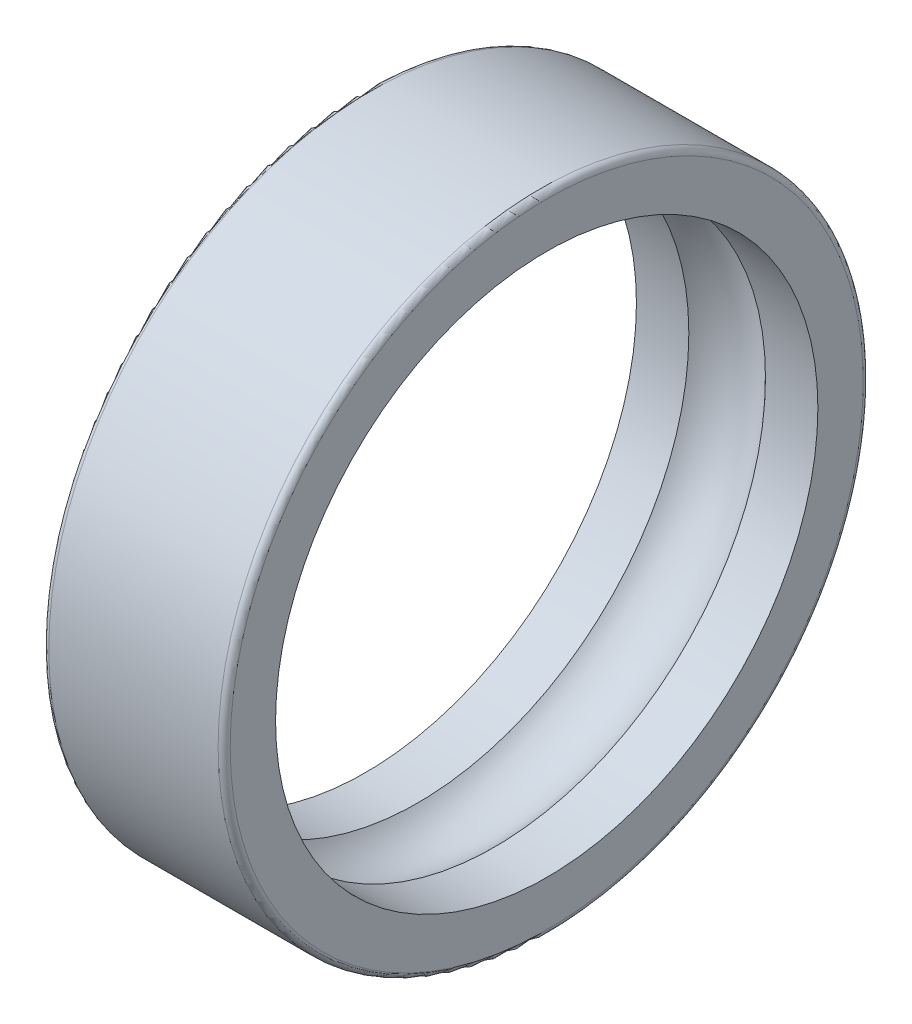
from build123d import *


with BuildPart() as part:
    # Esquisse1 → Base-R_volution (revolve)
    with BuildSketch(Plane(origin=(0, 0, 0), x_dir=(1, 0, 0), z_dir=(0, 1, 0)), mode=Mode.PRIVATE) as base_r_volution_sk:
        with BuildLine():
            Line((0, 15.7), (0, 13.45))
            Line((0, 13.45), (2.599342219, 13.45))
            ThreePointArc((2.599342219, 13.45), (4.5, 14.3), (6.400657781, 13.45))
            Line((6.400657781, 13.45), (9, 13.45))
            Line((9, 13.45), (9, 15.7))
            ThreePointArc((9, 15.7), (8.912132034, 15.912132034), (8.7, 16))
            Line((8.7, 16), (0.3, 16))
            ThreePointArc((0.3, 16), (0.087867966, 15.912132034), (0, 15.7))
        make_face()
    revolve(base_r_volution_sk.sketch.rotate(Axis((0, 0, 0), (1, 0, 0)), 180), axis=Axis((0, 0, 0), (1, 0, 0)))


solid = part.part
